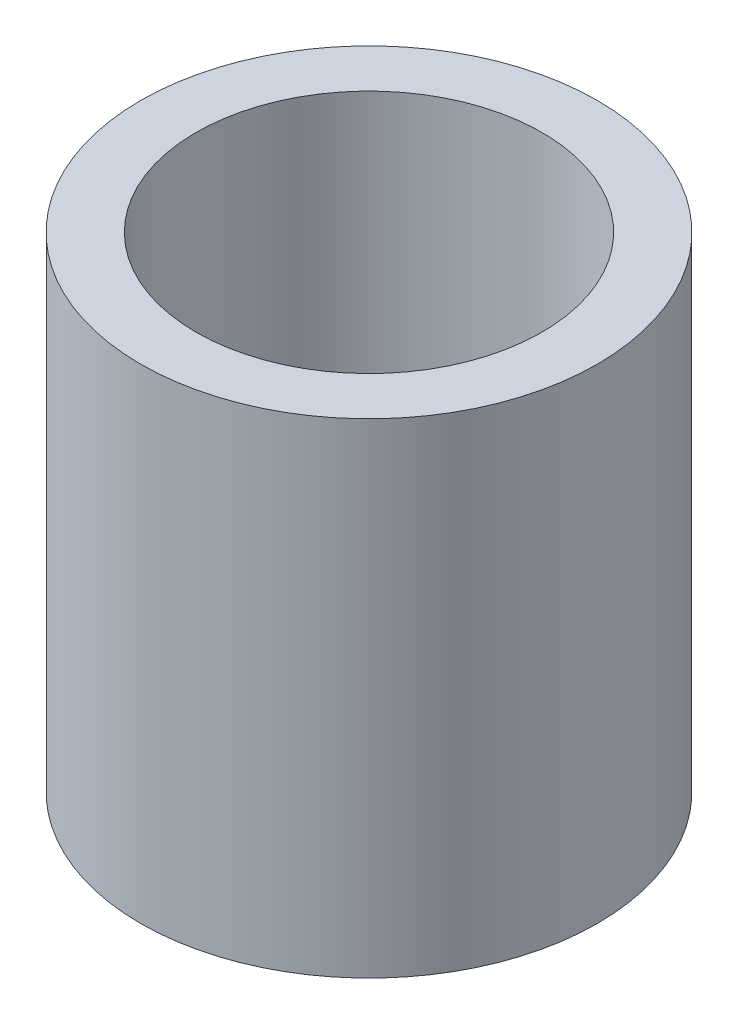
ISO-10303-21;
HEADER;
FILE_DESCRIPTION(('STEP AP214'),'2;1');
FILE_NAME('part.step','',(''),(''),'','','');
FILE_SCHEMA(('AUTOMOTIVE_DESIGN { 1 0 10303 214 1 1 1 1 }'));
ENDSEC;
DATA;
#1=APPLICATION_CONTEXT('core data for automotive mechanical design processes');
#2=APPLICATION_PROTOCOL_DEFINITION('international standard','automotive_design',2000,#1);
#3=PRODUCT_CONTEXT('',#1,'mechanical');
#4=PRODUCT('Part','Part','',(#3));
#5=PRODUCT_RELATED_PRODUCT_CATEGORY('part','',(#4));
#6=PRODUCT_DEFINITION_FORMATION('','',#4);
#7=PRODUCT_DEFINITION_CONTEXT('part definition',#1,'design');
#8=PRODUCT_DEFINITION('design','',#6,#7);
#9=PRODUCT_DEFINITION_SHAPE('','',#8);
#10=(LENGTH_UNIT() NAMED_UNIT(*) SI_UNIT(.MILLI.,.METRE.));
#11=(NAMED_UNIT(*) PLANE_ANGLE_UNIT() SI_UNIT($,.RADIAN.));
#12=(NAMED_UNIT(*) SI_UNIT($,.STERADIAN.) SOLID_ANGLE_UNIT());
#13=UNCERTAINTY_MEASURE_WITH_UNIT(LENGTH_MEASURE(1.E-05),#10,'distance_accuracy_value','');
#14=(GEOMETRIC_REPRESENTATION_CONTEXT(3) GLOBAL_UNCERTAINTY_ASSIGNED_CONTEXT((#13)) GLOBAL_UNIT_ASSIGNED_CONTEXT((#10,
#11,#12)) REPRESENTATION_CONTEXT('',''));
#15=CARTESIAN_POINT('',(0.,0.,0.));
#16=DIRECTION('',(0.,0.,1.));
#17=DIRECTION('',(1.,0.,0.));
#18=AXIS2_PLACEMENT_3D('',#15,#16,#17);
#19=CARTESIAN_POINT('',(0.,70.,0.));
#20=DIRECTION('',(0.,1.,0.));
#21=DIRECTION('',(0.,0.,1.));
#22=AXIS2_PLACEMENT_3D('',#19,#20,#21);
#23=PLANE('',#22);
#24=CARTESIAN_POINT('',(0.,70.,0.));
#25=DIRECTION('',(0.,1.,0.));
#26=DIRECTION('',(0.,0.,1.));
#27=AXIS2_PLACEMENT_3D('',#24,#25,#26);
#28=CIRCLE('',#27,33.);
#29=CARTESIAN_POINT('',(0.,70.,33.));
#30=VERTEX_POINT('',#29);
#31=EDGE_CURVE('E10',#30,#30,#28,.T.);
#32=ORIENTED_EDGE('',*,*,#31,.T.);
#33=EDGE_LOOP('',(#32));
#34=FACE_BOUND('',#33,.T.);
#35=CARTESIAN_POINT('',(0.,70.,0.));
#36=DIRECTION('',(0.,1.,0.));
#37=DIRECTION('',(0.,0.,1.));
#38=AXIS2_PLACEMENT_3D('',#35,#36,#37);
#39=CIRCLE('',#38,25.);
#40=CARTESIAN_POINT('',(0.,70.,25.));
#41=VERTEX_POINT('',#40);
#42=EDGE_CURVE('E35',#41,#41,#39,.T.);
#43=ORIENTED_EDGE('',*,*,#42,.F.);
#44=EDGE_LOOP('',(#43));
#45=FACE_BOUND('',#44,.T.);
#46=ADVANCED_FACE('F24',(#34,#45),#23,.T.);
#47=CARTESIAN_POINT('',(0.,0.,0.));
#48=DIRECTION('',(0.,1.,0.));
#49=DIRECTION('',(0.,0.,1.));
#50=AXIS2_PLACEMENT_3D('',#47,#48,#49);
#51=PLANE('',#50);
#52=CARTESIAN_POINT('',(0.,0.,0.));
#53=DIRECTION('',(0.,1.,0.));
#54=DIRECTION('',(0.,0.,1.));
#55=AXIS2_PLACEMENT_3D('',#52,#53,#54);
#56=CIRCLE('',#55,33.);
#57=CARTESIAN_POINT('',(0.,0.,33.));
#58=VERTEX_POINT('',#57);
#59=EDGE_CURVE('E31',#58,#58,#56,.T.);
#60=ORIENTED_EDGE('',*,*,#59,.F.);
#61=EDGE_LOOP('',(#60));
#62=FACE_BOUND('',#61,.T.);
#63=CARTESIAN_POINT('',(0.,0.,0.));
#64=DIRECTION('',(0.,1.,0.));
#65=DIRECTION('',(0.,0.,1.));
#66=AXIS2_PLACEMENT_3D('',#63,#64,#65);
#67=CIRCLE('',#66,25.);
#68=CARTESIAN_POINT('',(0.,0.,25.));
#69=VERTEX_POINT('',#68);
#70=EDGE_CURVE('E39',#69,#69,#67,.T.);
#71=ORIENTED_EDGE('',*,*,#70,.T.);
#72=EDGE_LOOP('',(#71));
#73=FACE_BOUND('',#72,.T.);
#74=ADVANCED_FACE('F45',(#62,#73),#51,.F.);
#75=CARTESIAN_POINT('',(0.,70.,0.));
#76=DIRECTION('',(0.,-1.,0.));
#77=DIRECTION('',(0.,0.,-1.));
#78=AXIS2_PLACEMENT_3D('',#75,#76,#77);
#79=CYLINDRICAL_SURFACE('',#78,33.);
#80=ORIENTED_EDGE('',*,*,#31,.F.);
#81=EDGE_LOOP('',(#80));
#82=FACE_BOUND('',#81,.T.);
#83=ORIENTED_EDGE('',*,*,#59,.T.);
#84=EDGE_LOOP('',(#83));
#85=FACE_BOUND('',#84,.T.);
#86=ADVANCED_FACE('F26',(#82,#85),#79,.T.);
#87=CARTESIAN_POINT('',(0.,70.,0.));
#88=DIRECTION('',(0.,-1.,0.));
#89=DIRECTION('',(0.,0.,-1.));
#90=AXIS2_PLACEMENT_3D('',#87,#88,#89);
#91=CYLINDRICAL_SURFACE('',#90,25.);
#92=ORIENTED_EDGE('',*,*,#42,.T.);
#93=EDGE_LOOP('',(#92));
#94=FACE_BOUND('',#93,.T.);
#95=ORIENTED_EDGE('',*,*,#70,.F.);
#96=EDGE_LOOP('',(#95));
#97=FACE_BOUND('',#96,.T.);
#98=ADVANCED_FACE('F47',(#94,#97),#91,.F.);
#99=CLOSED_SHELL('',(#46,#74,#86,#98));
#100=MANIFOLD_SOLID_BREP('B2',#99);
#101=ADVANCED_BREP_SHAPE_REPRESENTATION('',(#18,#100),#14);
#102=SHAPE_DEFINITION_REPRESENTATION(#9,#101);
ENDSEC;
END-ISO-10303-21;
